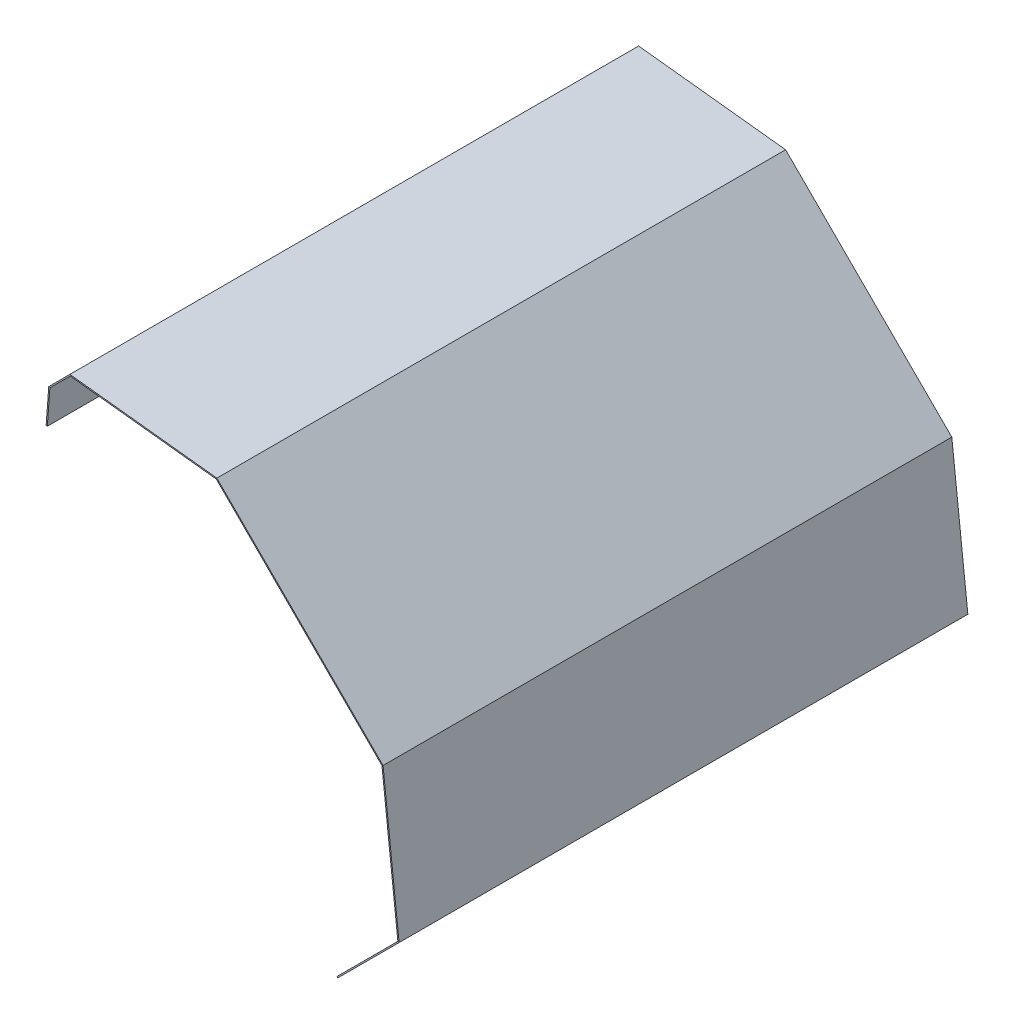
from build123d import *

# Parameters (mm, degrees)
EXTRU_MINCE1_DEPTH = 238


with BuildPart() as part:
    # Model → Extru.-Mince1 (new body)
    with BuildSketch(Plane.XY):
        Polygon((270.477763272, 304.573496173), (296.011813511, 330.087947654), (289.335167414, 390.497875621), (220.033932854, 459.616188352), (158.938048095, 466.416959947), (150.39298637, 457.871898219), (149.318749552, 443.410179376), (148.820123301, 443.447218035), (149.908116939, 458.094135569), (158.754464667, 466.9404833), (220.26313738, 460.093763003), (289.812815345, 390.727662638), (296.53517987, 329.904076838), (270.831180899, 304.21980707), align=None)
    extrude(amount=EXTRU_MINCE1_DEPTH)


solid = part.part
